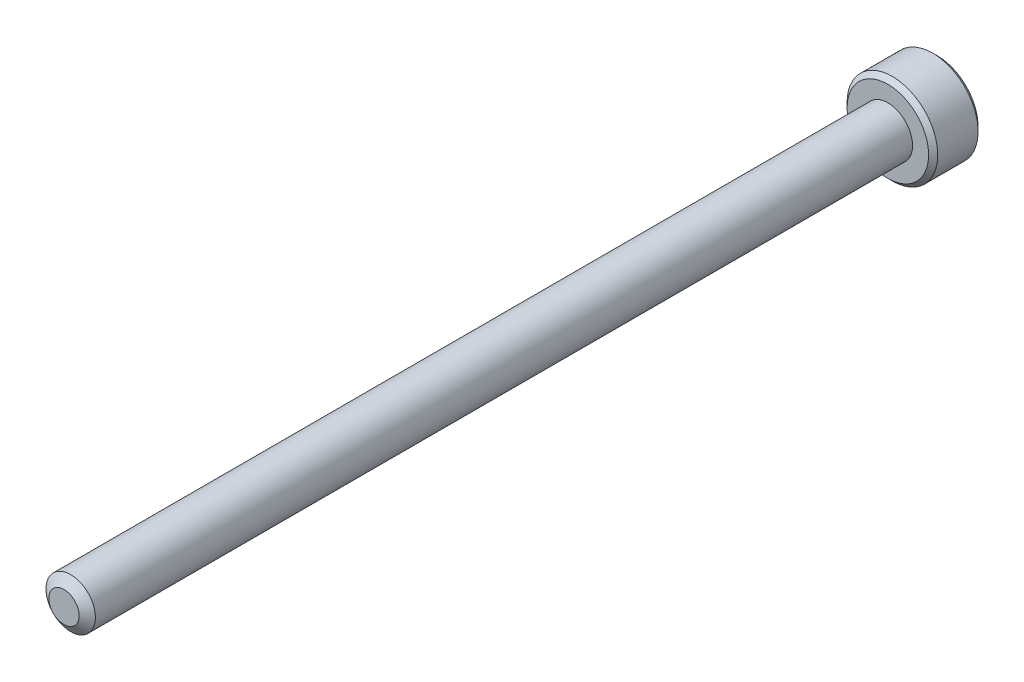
ISO-10303-21;
HEADER;
FILE_DESCRIPTION(('STEP AP214'),'2;1');
FILE_NAME('part.step','',(''),(''),'','','');
FILE_SCHEMA(('AUTOMOTIVE_DESIGN { 1 0 10303 214 1 1 1 1 }'));
ENDSEC;
DATA;
#1=APPLICATION_CONTEXT('core data for automotive mechanical design processes');
#2=APPLICATION_PROTOCOL_DEFINITION('international standard','automotive_design',2000,#1);
#3=PRODUCT_CONTEXT('',#1,'mechanical');
#4=PRODUCT('Part','Part','',(#3));
#5=PRODUCT_RELATED_PRODUCT_CATEGORY('part','',(#4));
#6=PRODUCT_DEFINITION_FORMATION('','',#4);
#7=PRODUCT_DEFINITION_CONTEXT('part definition',#1,'design');
#8=PRODUCT_DEFINITION('design','',#6,#7);
#9=PRODUCT_DEFINITION_SHAPE('','',#8);
#10=(LENGTH_UNIT() NAMED_UNIT(*) SI_UNIT(.MILLI.,.METRE.));
#11=(NAMED_UNIT(*) PLANE_ANGLE_UNIT() SI_UNIT($,.RADIAN.));
#12=(NAMED_UNIT(*) SI_UNIT($,.STERADIAN.) SOLID_ANGLE_UNIT());
#13=UNCERTAINTY_MEASURE_WITH_UNIT(LENGTH_MEASURE(1.E-05),#10,'distance_accuracy_value','');
#14=(GEOMETRIC_REPRESENTATION_CONTEXT(3) GLOBAL_UNCERTAINTY_ASSIGNED_CONTEXT((#13)) GLOBAL_UNIT_ASSIGNED_CONTEXT((#10,
#11,#12)) REPRESENTATION_CONTEXT('',''));
#15=CARTESIAN_POINT('',(0.,0.,0.));
#16=DIRECTION('',(0.,0.,1.));
#17=DIRECTION('',(1.,0.,0.));
#18=AXIS2_PLACEMENT_3D('',#15,#16,#17);
#19=CARTESIAN_POINT('',(0.,0.,-50.));
#20=DIRECTION('',(0.,0.,1.));
#21=DIRECTION('',(1.,0.,0.));
#22=AXIS2_PLACEMENT_3D('',#19,#20,#21);
#23=CYLINDRICAL_SURFACE('',#22,1.5);
#24=CARTESIAN_POINT('',(0.,0.,-50.));
#25=DIRECTION('',(0.,0.,-1.));
#26=DIRECTION('',(-1.,0.,0.));
#27=AXIS2_PLACEMENT_3D('',#24,#25,#26);
#28=CIRCLE('',#27,1.5);
#29=CARTESIAN_POINT('',(-1.5,0.,-50.));
#30=VERTEX_POINT('',#29);
#31=EDGE_CURVE('E212',#30,#30,#28,.F.);
#32=ORIENTED_EDGE('',*,*,#31,.T.);
#33=EDGE_LOOP('',(#32));
#34=FACE_BOUND('',#33,.T.);
#35=CARTESIAN_POINT('',(0.,0.,-0.40525178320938));
#36=DIRECTION('',(0.,0.,1.));
#37=DIRECTION('',(1.,0.,0.));
#38=AXIS2_PLACEMENT_3D('',#35,#36,#37);
#39=CIRCLE('',#38,1.5);
#40=CARTESIAN_POINT('',(1.5,0.,-0.40525178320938));
#41=VERTEX_POINT('',#40);
#42=EDGE_CURVE('E106',#41,#41,#39,.T.);
#43=ORIENTED_EDGE('',*,*,#42,.F.);
#44=EDGE_LOOP('',(#43));
#45=FACE_BOUND('',#44,.T.);
#46=ADVANCED_FACE('F32',(#34,#45),#23,.T.);
#47=CARTESIAN_POINT('',(0.,0.,0.));
#48=DIRECTION('',(0.,0.,-1.));
#49=DIRECTION('',(-1.,0.,0.));
#50=AXIS2_PLACEMENT_3D('',#47,#48,#49);
#51=CONICAL_SURFACE('',#50,0.921240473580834,0.959931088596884);
#52=ORIENTED_EDGE('',*,*,#42,.T.);
#53=EDGE_LOOP('',(#52));
#54=FACE_BOUND('',#53,.T.);
#55=CARTESIAN_POINT('',(0.,0.,0.));
#56=DIRECTION('',(0.,0.,1.));
#57=DIRECTION('',(1.,0.,0.));
#58=AXIS2_PLACEMENT_3D('',#55,#56,#57);
#59=CIRCLE('',#58,0.921240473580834);
#60=CARTESIAN_POINT('',(0.921240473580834,0.,0.));
#61=VERTEX_POINT('',#60);
#62=EDGE_CURVE('E210',#61,#61,#59,.T.);
#63=ORIENTED_EDGE('',*,*,#62,.F.);
#64=EDGE_LOOP('',(#63));
#65=FACE_BOUND('',#64,.T.);
#66=ADVANCED_FACE('F193',(#54,#65),#51,.T.);
#67=CARTESIAN_POINT('',(0.,0.,0.));
#68=DIRECTION('',(0.,0.,1.));
#69=DIRECTION('',(1.,0.,0.));
#70=AXIS2_PLACEMENT_3D('',#67,#68,#69);
#71=PLANE('',#70);
#72=ORIENTED_EDGE('',*,*,#62,.T.);
#73=EDGE_LOOP('',(#72));
#74=FACE_BOUND('',#73,.T.);
#75=ADVANCED_FACE('F190',(#74),#71,.T.);
#76=CARTESIAN_POINT('',(0.,0.,-53.));
#77=DIRECTION('',(0.,0.,1.));
#78=DIRECTION('',(1.,0.,0.));
#79=AXIS2_PLACEMENT_3D('',#76,#77,#78);
#80=CYLINDRICAL_SURFACE('',#79,2.75);
#81=CARTESIAN_POINT('',(0.,0.,-52.725));
#82=DIRECTION('',(0.,0.,-1.));
#83=DIRECTION('',(-1.,0.,0.));
#84=AXIS2_PLACEMENT_3D('',#81,#82,#83);
#85=CIRCLE('',#84,2.75);
#86=CARTESIAN_POINT('',(-2.75,0.,-52.725));
#87=VERTEX_POINT('',#86);
#88=EDGE_CURVE('E40',#87,#87,#85,.F.);
#89=ORIENTED_EDGE('',*,*,#88,.T.);
#90=EDGE_LOOP('',(#89));
#91=FACE_BOUND('',#90,.T.);
#92=CARTESIAN_POINT('',(0.,0.,-50.275));
#93=DIRECTION('',(0.,0.,-1.));
#94=DIRECTION('',(-1.,0.,0.));
#95=AXIS2_PLACEMENT_3D('',#92,#93,#94);
#96=CIRCLE('',#95,2.75);
#97=CARTESIAN_POINT('',(-2.75,0.,-50.275));
#98=VERTEX_POINT('',#97);
#99=EDGE_CURVE('E169',#98,#98,#96,.T.);
#100=ORIENTED_EDGE('',*,*,#99,.T.);
#101=EDGE_LOOP('',(#100));
#102=FACE_BOUND('',#101,.T.);
#103=ADVANCED_FACE('F174',(#91,#102),#80,.T.);
#104=CARTESIAN_POINT('',(0.,0.,-53.));
#105=DIRECTION('',(0.,0.,-1.));
#106=DIRECTION('',(-1.,0.,0.));
#107=AXIS2_PLACEMENT_3D('',#104,#105,#106);
#108=PLANE('',#107);
#109=CARTESIAN_POINT('',(0.,0.,-53.));
#110=DIRECTION('',(0.,0.,-1.));
#111=DIRECTION('',(-1.,0.,0.));
#112=AXIS2_PLACEMENT_3D('',#109,#110,#111);
#113=CIRCLE('',#112,2.47500000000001);
#114=CARTESIAN_POINT('',(-2.47500000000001,0.,-53.));
#115=VERTEX_POINT('',#114);
#116=EDGE_CURVE('E105',#115,#115,#113,.T.);
#117=ORIENTED_EDGE('',*,*,#116,.T.);
#118=EDGE_LOOP('',(#117));
#119=FACE_BOUND('',#118,.T.);
#120=CARTESIAN_POINT('',(0.,0.,-53.));
#121=DIRECTION('',(0.,0.,-1.));
#122=DIRECTION('',(-1.,0.,0.));
#123=AXIS2_PLACEMENT_3D('',#120,#121,#122);
#124=CIRCLE('',#123,1.44337567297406);
#125=CARTESIAN_POINT('',(-1.25,0.721687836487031,-53.));
#126=VERTEX_POINT('',#125);
#127=CARTESIAN_POINT('',(0.,1.44337567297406,-53.));
#128=VERTEX_POINT('',#127);
#129=EDGE_CURVE('E86',#126,#128,#124,.T.);
#130=ORIENTED_EDGE('',*,*,#129,.F.);
#131=CARTESIAN_POINT('',(-1.25,-0.721687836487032,-53.));
#132=VERTEX_POINT('',#131);
#133=EDGE_CURVE('E46',#132,#126,#124,.T.);
#134=ORIENTED_EDGE('',*,*,#133,.F.);
#135=CARTESIAN_POINT('',(0.,-1.44337567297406,-53.));
#136=VERTEX_POINT('',#135);
#137=EDGE_CURVE('E271',#136,#132,#124,.T.);
#138=ORIENTED_EDGE('',*,*,#137,.F.);
#139=CARTESIAN_POINT('',(1.25,-0.721687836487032,-53.));
#140=VERTEX_POINT('',#139);
#141=EDGE_CURVE('E53',#140,#136,#124,.T.);
#142=ORIENTED_EDGE('',*,*,#141,.F.);
#143=CARTESIAN_POINT('',(1.25,0.721687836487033,-53.));
#144=VERTEX_POINT('',#143);
#145=EDGE_CURVE('E127',#144,#140,#124,.T.);
#146=ORIENTED_EDGE('',*,*,#145,.F.);
#147=EDGE_CURVE('E95',#128,#144,#124,.T.);
#148=ORIENTED_EDGE('',*,*,#147,.F.);
#149=EDGE_LOOP('',(#130,#134,#138,#142,#146,#148));
#150=FACE_BOUND('',#149,.T.);
#151=ADVANCED_FACE('F126',(#119,#150),#108,.T.);
#152=CARTESIAN_POINT('',(0.,0.,-50.));
#153=DIRECTION('',(0.,0.,-1.));
#154=DIRECTION('',(-1.,0.,0.));
#155=AXIS2_PLACEMENT_3D('',#152,#153,#154);
#156=PLANE('',#155);
#157=CARTESIAN_POINT('',(0.,0.,-50.));
#158=DIRECTION('',(0.,0.,-1.));
#159=DIRECTION('',(-1.,0.,0.));
#160=AXIS2_PLACEMENT_3D('',#157,#158,#159);
#161=CIRCLE('',#160,2.475);
#162=CARTESIAN_POINT('',(-2.475,0.,-50.));
#163=VERTEX_POINT('',#162);
#164=EDGE_CURVE('E11',#163,#163,#161,.F.);
#165=ORIENTED_EDGE('',*,*,#164,.T.);
#166=EDGE_LOOP('',(#165));
#167=FACE_BOUND('',#166,.T.);
#168=ORIENTED_EDGE('',*,*,#31,.F.);
#169=EDGE_LOOP('',(#168));
#170=FACE_BOUND('',#169,.T.);
#171=ADVANCED_FACE('F183',(#167,#170),#156,.F.);
#172=CARTESIAN_POINT('',(0.,0.,-53.));
#173=DIRECTION('',(0.,0.,-1.));
#174=DIRECTION('',(-1.,0.,0.));
#175=AXIS2_PLACEMENT_3D('',#172,#173,#174);
#176=CONICAL_SURFACE('',#175,1.44337567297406,0.78539816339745);
#177=ORIENTED_EDGE('',*,*,#147,.T.);
#178=CARTESIAN_POINT('',(-0.000200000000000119,1.4434911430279,-53.0001154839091));
#179=CARTESIAN_POINT('',(0.0427751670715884,1.41867941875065,-52.9753216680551));
#180=CARTESIAN_POINT('',(0.0864690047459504,1.39345276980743,-52.9519837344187));
#181=CARTESIAN_POINT('',(0.175565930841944,1.34201263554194,-52.9092520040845));
#182=CARTESIAN_POINT('',(0.220977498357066,1.31579425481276,-52.8898819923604));
#183=CARTESIAN_POINT('',(0.312547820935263,1.26292610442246,-52.8567004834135));
#184=CARTESIAN_POINT('',(0.35868324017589,1.23628980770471,-52.8428055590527));
#185=CARTESIAN_POINT('',(0.451970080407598,1.18243062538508,-52.8213972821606));
#186=CARTESIAN_POINT('',(0.499118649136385,1.15520938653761,-52.8138679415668));
#187=CARTESIAN_POINT('',(0.580373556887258,1.10829684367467,-52.8070744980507));
#188=CARTESIAN_POINT('',(0.614374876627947,1.08866617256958,-52.8060685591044));
#189=CARTESIAN_POINT('',(0.682317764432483,1.04943932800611,-52.8077614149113));
#190=CARTESIAN_POINT('',(0.716259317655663,1.02984316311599,-52.8104610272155));
#191=CARTESIAN_POINT('',(0.783814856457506,0.990839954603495,-52.8194089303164));
#192=CARTESIAN_POINT('',(0.817428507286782,0.971433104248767,-52.8256605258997));
#193=CARTESIAN_POINT('',(0.88409463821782,0.932943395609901,-52.8413756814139));
#194=CARTESIAN_POINT('',(0.917146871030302,0.913860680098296,-52.8508406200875));
#195=CARTESIAN_POINT('',(1.00179969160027,0.864986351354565,-52.8789313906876));
#196=CARTESIAN_POINT('',(1.05286649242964,0.835502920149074,-52.8996701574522));
#197=CARTESIAN_POINT('',(1.15300085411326,0.777690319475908,-52.9463871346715));
#198=CARTESIAN_POINT('',(1.20207431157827,0.749357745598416,-52.9723482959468));
#199=CARTESIAN_POINT('',(1.2502,0.721572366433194,-53.0001154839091));
#200=B_SPLINE_CURVE_WITH_KNOTS('',3,(#178,#179,#180,#181,#182,#183,#184,#185,#186,#187,#188,
#189,#190,#191,#192,#193,#194,#195,#196,#197,#198,#199),.UNSPECIFIED.,.F.,.F.,(4,2,2,2,2,2,2,2,
2,2,4),(0.,0.166533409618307,0.334037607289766,0.498880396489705,0.663307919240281,
0.780963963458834,0.898645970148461,1.01643764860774,1.1342799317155,1.32148652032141,
1.50809158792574),.UNSPECIFIED.);
#201=EDGE_CURVE('E100',#128,#144,#200,.T.);
#202=ORIENTED_EDGE('',*,*,#201,.F.);
#203=EDGE_LOOP('',(#177,#202));
#204=FACE_BOUND('',#203,.T.);
#205=ADVANCED_FACE('F101',(#204),#176,.F.);
#206=ORIENTED_EDGE('',*,*,#145,.T.);
#207=CARTESIAN_POINT('',(1.25,-1.43934010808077,-53.4629820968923));
#208=CARTESIAN_POINT('',(1.25,-1.40429313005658,-53.4365249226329));
#209=CARTESIAN_POINT('',(1.25,-1.36905087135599,-53.4103271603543));
#210=CARTESIAN_POINT('',(1.25,-1.29809650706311,-53.3585575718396));
#211=CARTESIAN_POINT('',(1.25,-1.26238428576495,-53.3329859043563));
#212=CARTESIAN_POINT('',(1.25,-1.15390111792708,-53.2570059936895));
#213=CARTESIAN_POINT('',(1.25,-1.08031646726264,-53.2077402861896));
#214=CARTESIAN_POINT('',(1.25,-0.926012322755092,-53.1110258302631));
#215=CARTESIAN_POINT('',(1.25,-0.845125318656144,-53.0638412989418));
#216=CARTESIAN_POINT('',(1.25,-0.6793111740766,-52.9775307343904));
#217=CARTESIAN_POINT('',(1.25,-0.594398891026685,-52.9383775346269));
#218=CARTESIAN_POINT('',(1.25,-0.466944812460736,-52.8904772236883));
#219=CARTESIAN_POINT('',(1.25,-0.426289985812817,-52.8767294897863));
#220=CARTESIAN_POINT('',(1.25,-0.343998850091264,-52.8524979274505));
#221=CARTESIAN_POINT('',(1.25,-0.30236247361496,-52.8420143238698));
#222=CARTESIAN_POINT('',(1.25,-0.219052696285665,-52.8250301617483));
#223=CARTESIAN_POINT('',(1.25,-0.1773934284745,-52.8184613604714));
#224=CARTESIAN_POINT('',(1.25,-0.0936293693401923,-52.8094350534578));
#225=CARTESIAN_POINT('',(1.25,-0.0515246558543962,-52.8069768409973));
#226=CARTESIAN_POINT('',(1.25,0.0311890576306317,-52.8063540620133));
#227=CARTESIAN_POINT('',(1.25,0.0717969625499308,-52.8080371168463));
#228=CARTESIAN_POINT('',(1.25,0.152668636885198,-52.8152682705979));
#229=CARTESIAN_POINT('',(1.25,0.192932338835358,-52.8208171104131));
#230=CARTESIAN_POINT('',(1.25,0.273499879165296,-52.835571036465));
#231=CARTESIAN_POINT('',(1.25,0.313792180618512,-52.8448381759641));
#232=CARTESIAN_POINT('',(1.25,0.393496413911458,-52.8665361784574));
#233=CARTESIAN_POINT('',(1.25,0.432908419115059,-52.8789667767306));
#234=CARTESIAN_POINT('',(1.25,0.556992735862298,-52.9227793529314));
#235=CARTESIAN_POINT('',(1.25,0.639898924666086,-52.959151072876));
#236=CARTESIAN_POINT('',(1.25,0.801816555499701,-53.0400191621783));
#237=CARTESIAN_POINT('',(1.25,0.880812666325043,-53.084544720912));
#238=CARTESIAN_POINT('',(1.25,1.03178561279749,-53.1764048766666));
#239=CARTESIAN_POINT('',(1.25,1.10391618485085,-53.2234899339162));
#240=CARTESIAN_POINT('',(1.25,1.2101860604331,-53.2962785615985));
#241=CARTESIAN_POINT('',(1.25,1.24515069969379,-53.3207980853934));
#242=CARTESIAN_POINT('',(1.25,1.31460220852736,-53.3704856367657));
#243=CARTESIAN_POINT('',(1.25,1.34908920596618,-53.3956534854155));
#244=CARTESIAN_POINT('',(1.25,1.38337731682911,-53.4210901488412));
#245=B_SPLINE_CURVE_WITH_KNOTS('',3,(#207,#208,#209,#210,#211,#212,#213,#214,#215,#216,#217,
#218,#219,#220,#221,#222,#223,#224,#225,#226,#227,#228,#229,#230,#231,#232,#233,#234,#235,#236,
#237,#238,#239,#240,#241,#242,#243,#244),.UNSPECIFIED.,.F.,.F.,(4,2,2,2,2,2,2,2,2,2,2,2,2,2,2,2,
2,2,4),(0.,0.131732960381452,0.263498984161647,0.529042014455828,0.80974192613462,
1.08947609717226,1.21811634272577,1.34676544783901,1.47310084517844,1.59941451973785,
1.72115042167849,1.84290966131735,1.96679153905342,2.09066305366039,2.36146692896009,
2.63325989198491,2.89154668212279,3.01965734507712,3.14773302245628),.UNSPECIFIED.);
#246=EDGE_CURVE('E94',#144,#140,#245,.F.);
#247=ORIENTED_EDGE('',*,*,#246,.F.);
#248=EDGE_LOOP('',(#206,#247));
#249=FACE_BOUND('',#248,.T.);
#250=ADVANCED_FACE('F277',(#249),#176,.F.);
#251=ORIENTED_EDGE('',*,*,#141,.T.);
#252=CARTESIAN_POINT('',(1.2502,-0.721572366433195,-53.0001154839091));
#253=CARTESIAN_POINT('',(1.20722483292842,-0.746384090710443,-52.9753216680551));
#254=CARTESIAN_POINT('',(1.16353099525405,-0.771610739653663,-52.9519837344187));
#255=CARTESIAN_POINT('',(1.07443406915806,-0.823050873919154,-52.9092520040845));
#256=CARTESIAN_POINT('',(1.02902250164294,-0.849269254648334,-52.8898819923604));
#257=CARTESIAN_POINT('',(0.937452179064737,-0.902137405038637,-52.8567004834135));
#258=CARTESIAN_POINT('',(0.891316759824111,-0.928773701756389,-52.8428055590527));
#259=CARTESIAN_POINT('',(0.798029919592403,-0.982632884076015,-52.8213972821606));
#260=CARTESIAN_POINT('',(0.750881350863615,-1.00985412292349,-52.8138679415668));
#261=CARTESIAN_POINT('',(0.669626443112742,-1.05676666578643,-52.8070744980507));
#262=CARTESIAN_POINT('',(0.635625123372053,-1.07639733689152,-52.8060685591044));
#263=CARTESIAN_POINT('',(0.567682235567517,-1.11562418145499,-52.8077614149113));
#264=CARTESIAN_POINT('',(0.533740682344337,-1.13522034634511,-52.8104610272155));
#265=CARTESIAN_POINT('',(0.466185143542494,-1.1742235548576,-52.8194089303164));
#266=CARTESIAN_POINT('',(0.432571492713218,-1.19363040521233,-52.8256605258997));
#267=CARTESIAN_POINT('',(0.365905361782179,-1.2321201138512,-52.8413756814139));
#268=CARTESIAN_POINT('',(0.332853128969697,-1.2512028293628,-52.8508406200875));
#269=CARTESIAN_POINT('',(0.248200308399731,-1.30007715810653,-52.8789313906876));
#270=CARTESIAN_POINT('',(0.197133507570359,-1.32956058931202,-52.8996701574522));
#271=CARTESIAN_POINT('',(0.0969991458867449,-1.38737318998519,-52.9463871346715));
#272=CARTESIAN_POINT('',(0.0479256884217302,-1.41570576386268,-52.9723482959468));
#273=CARTESIAN_POINT('',(-0.000200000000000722,-1.4434911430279,-53.0001154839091));
#274=B_SPLINE_CURVE_WITH_KNOTS('',3,(#252,#253,#254,#255,#256,#257,#258,#259,#260,#261,#262,
#263,#264,#265,#266,#267,#268,#269,#270,#271,#272,#273),.UNSPECIFIED.,.F.,.F.,(4,2,2,2,2,2,2,2,
2,2,4),(0.,0.166533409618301,0.334037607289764,0.498880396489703,0.663307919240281,
0.780963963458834,0.898645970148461,1.01643764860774,1.1342799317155,1.32148652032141,
1.50809158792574),.UNSPECIFIED.);
#275=EDGE_CURVE('E137',#140,#136,#274,.T.);
#276=ORIENTED_EDGE('',*,*,#275,.F.);
#277=EDGE_LOOP('',(#251,#276));
#278=FACE_BOUND('',#277,.T.);
#279=ADVANCED_FACE('F274',(#278),#176,.F.);
#280=ORIENTED_EDGE('',*,*,#137,.T.);
#281=CARTESIAN_POINT('',(0.000200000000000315,-1.4434911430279,-53.0001154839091));
#282=CARTESIAN_POINT('',(-0.0427751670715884,-1.41867941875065,-52.9753216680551));
#283=CARTESIAN_POINT('',(-0.0864690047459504,-1.39345276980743,-52.9519837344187));
#284=CARTESIAN_POINT('',(-0.175565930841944,-1.34201263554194,-52.9092520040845));
#285=CARTESIAN_POINT('',(-0.220977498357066,-1.31579425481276,-52.8898819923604));
#286=CARTESIAN_POINT('',(-0.312547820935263,-1.26292610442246,-52.8567004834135));
#287=CARTESIAN_POINT('',(-0.35868324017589,-1.23628980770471,-52.8428055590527));
#288=CARTESIAN_POINT('',(-0.451970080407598,-1.18243062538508,-52.8213972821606));
#289=CARTESIAN_POINT('',(-0.499118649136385,-1.15520938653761,-52.8138679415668));
#290=CARTESIAN_POINT('',(-0.580373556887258,-1.10829684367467,-52.8070744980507));
#291=CARTESIAN_POINT('',(-0.614374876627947,-1.08866617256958,-52.8060685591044));
#292=CARTESIAN_POINT('',(-0.682317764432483,-1.04943932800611,-52.8077614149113));
#293=CARTESIAN_POINT('',(-0.716259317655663,-1.02984316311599,-52.8104610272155));
#294=CARTESIAN_POINT('',(-0.783814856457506,-0.990839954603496,-52.8194089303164));
#295=CARTESIAN_POINT('',(-0.817428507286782,-0.971433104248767,-52.8256605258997));
#296=CARTESIAN_POINT('',(-0.88409463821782,-0.932943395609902,-52.8413756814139));
#297=CARTESIAN_POINT('',(-0.917146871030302,-0.913860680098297,-52.8508406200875));
#298=CARTESIAN_POINT('',(-1.00179969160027,-0.864986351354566,-52.8789313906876));
#299=CARTESIAN_POINT('',(-1.05286649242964,-0.835502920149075,-52.8996701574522));
#300=CARTESIAN_POINT('',(-1.15300085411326,-0.777690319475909,-52.9463871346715));
#301=CARTESIAN_POINT('',(-1.20207431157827,-0.749357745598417,-52.9723482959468));
#302=CARTESIAN_POINT('',(-1.2502,-0.721572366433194,-53.0001154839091));
#303=B_SPLINE_CURVE_WITH_KNOTS('',3,(#281,#282,#283,#284,#285,#286,#287,#288,#289,#290,#291,
#292,#293,#294,#295,#296,#297,#298,#299,#300,#301,#302),.UNSPECIFIED.,.F.,.F.,(4,2,2,2,2,2,2,2,
2,2,4),(0.,0.166533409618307,0.334037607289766,0.498880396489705,0.663307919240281,
0.780963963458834,0.898645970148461,1.01643764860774,1.1342799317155,1.32148652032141,
1.50809158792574),.UNSPECIFIED.);
#304=EDGE_CURVE('E248',#136,#132,#303,.T.);
#305=ORIENTED_EDGE('',*,*,#304,.F.);
#306=EDGE_LOOP('',(#280,#305));
#307=FACE_BOUND('',#306,.T.);
#308=ADVANCED_FACE('F273',(#307),#176,.F.);
#309=ORIENTED_EDGE('',*,*,#133,.T.);
#310=CARTESIAN_POINT('',(-1.25,-1.43934010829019,-53.4629820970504));
#311=CARTESIAN_POINT('',(-1.25,-1.40429313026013,-53.4365249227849));
#312=CARTESIAN_POINT('',(-1.25,-1.36905087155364,-53.4103271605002));
#313=CARTESIAN_POINT('',(-1.25,-1.29809650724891,-53.3585575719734));
#314=CARTESIAN_POINT('',(-1.25,-1.2623842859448,-53.3329859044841));
#315=CARTESIAN_POINT('',(-1.25,-1.15390111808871,-53.257005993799));
#316=CARTESIAN_POINT('',(-1.25,-1.08031646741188,-53.207740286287));
#317=CARTESIAN_POINT('',(-1.25,-0.926012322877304,-53.1110258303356));
#318=CARTESIAN_POINT('',(-1.25,-0.84512531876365,-53.0638412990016));
#319=CARTESIAN_POINT('',(-1.25,-0.679311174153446,-52.9775307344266));
#320=CARTESIAN_POINT('',(-1.25,-0.594398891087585,-52.9383775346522));
#321=CARTESIAN_POINT('',(-1.25,-0.466944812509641,-52.8904772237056));
#322=CARTESIAN_POINT('',(-1.25,-0.426289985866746,-52.8767294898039));
#323=CARTESIAN_POINT('',(-1.25,-0.343998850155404,-52.8524979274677));
#324=CARTESIAN_POINT('',(-1.25,-0.302362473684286,-52.8420143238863));
#325=CARTESIAN_POINT('',(-1.25,-0.219052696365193,-52.8250301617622));
#326=CARTESIAN_POINT('',(-1.25,-0.177393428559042,-52.8184613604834));
#327=CARTESIAN_POINT('',(-1.25,-0.0936293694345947,-52.809435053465));
#328=CARTESIAN_POINT('',(-1.25,-0.051524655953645,-52.8069768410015));
#329=CARTESIAN_POINT('',(-1.25,0.0311890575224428,-52.8063540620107));
#330=CARTESIAN_POINT('',(-1.25,0.0717969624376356,-52.8080371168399));
#331=CARTESIAN_POINT('',(-1.25,0.152668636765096,-52.8152682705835));
#332=CARTESIAN_POINT('',(-1.25,0.192932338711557,-52.8208171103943));
#333=CARTESIAN_POINT('',(-1.25,0.273499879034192,-52.835571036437));
#334=CARTESIAN_POINT('',(-1.25,0.313792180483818,-52.8448381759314));
#335=CARTESIAN_POINT('',(-1.25,0.393496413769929,-52.8665361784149));
#336=CARTESIAN_POINT('',(-1.25,0.432908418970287,-52.8789667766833));
#337=CARTESIAN_POINT('',(-1.25,0.556992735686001,-52.9227793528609));
#338=CARTESIAN_POINT('',(-1.25,0.639898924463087,-52.9591510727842));
#339=CARTESIAN_POINT('',(-1.25,0.801816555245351,-53.0400191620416));
#340=CARTESIAN_POINT('',(-1.25,0.880812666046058,-53.0845447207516));
#341=CARTESIAN_POINT('',(-1.25,1.03178561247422,-53.176404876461));
#342=CARTESIAN_POINT('',(-1.25,1.10391618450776,-53.2234899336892));
#343=CARTESIAN_POINT('',(-1.25,1.21018606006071,-53.2962785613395));
#344=CARTESIAN_POINT('',(-1.25,1.24515069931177,-53.3207980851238));
#345=CARTESIAN_POINT('',(-1.25,1.31460220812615,-53.3704856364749));
#346=CARTESIAN_POINT('',(-1.25,1.3490892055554,-53.3956534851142));
#347=CARTESIAN_POINT('',(-1.25,1.38337731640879,-53.4210901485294));
#348=B_SPLINE_CURVE_WITH_KNOTS('',3,(#310,#311,#312,#313,#314,#315,#316,#317,#318,#319,#320,
#321,#322,#323,#324,#325,#326,#327,#328,#329,#330,#331,#332,#333,#334,#335,#336,#337,#338,#339,
#340,#341,#342,#343,#344,#345,#346,#347),.UNSPECIFIED.,.F.,.F.,(4,2,2,2,2,2,2,2,2,2,2,2,2,2,2,2,
2,2,4),(0.,0.131732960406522,0.263498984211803,0.529042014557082,0.80974192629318,
1.08947609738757,1.21811634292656,1.3467654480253,1.47310084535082,1.59941451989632,
1.72115042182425,1.84290966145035,1.9667915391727,2.09066305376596,2.36146692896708,
2.63325989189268,2.89154668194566,3.01965734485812,3.14773302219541),.UNSPECIFIED.);
#349=EDGE_CURVE('E116',#132,#126,#348,.T.);
#350=ORIENTED_EDGE('',*,*,#349,.F.);
#351=EDGE_LOOP('',(#309,#350));
#352=FACE_BOUND('',#351,.T.);
#353=ADVANCED_FACE('F286',(#352),#176,.F.);
#354=ORIENTED_EDGE('',*,*,#129,.T.);
#355=CARTESIAN_POINT('',(-1.2502,0.721572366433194,-53.0001154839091));
#356=CARTESIAN_POINT('',(-1.20722483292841,0.746384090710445,-52.9753216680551));
#357=CARTESIAN_POINT('',(-1.16353099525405,0.771610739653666,-52.9519837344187));
#358=CARTESIAN_POINT('',(-1.07443406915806,0.823050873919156,-52.9092520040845));
#359=CARTESIAN_POINT('',(-1.02902250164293,0.849269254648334,-52.8898819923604));
#360=CARTESIAN_POINT('',(-0.937452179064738,0.902137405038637,-52.8567004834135));
#361=CARTESIAN_POINT('',(-0.891316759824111,0.928773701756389,-52.8428055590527));
#362=CARTESIAN_POINT('',(-0.798029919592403,0.982632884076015,-52.8213972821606));
#363=CARTESIAN_POINT('',(-0.750881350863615,1.00985412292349,-52.8138679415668));
#364=CARTESIAN_POINT('',(-0.669626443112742,1.05676666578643,-52.8070744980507));
#365=CARTESIAN_POINT('',(-0.635625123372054,1.07639733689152,-52.8060685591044));
#366=CARTESIAN_POINT('',(-0.567682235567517,1.11562418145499,-52.8077614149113));
#367=CARTESIAN_POINT('',(-0.533740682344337,1.13522034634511,-52.8104610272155));
#368=CARTESIAN_POINT('',(-0.466185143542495,1.1742235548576,-52.8194089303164));
#369=CARTESIAN_POINT('',(-0.43257149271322,1.19363040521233,-52.8256605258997));
#370=CARTESIAN_POINT('',(-0.365905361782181,1.23212011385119,-52.8413756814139));
#371=CARTESIAN_POINT('',(-0.332853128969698,1.2512028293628,-52.8508406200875));
#372=CARTESIAN_POINT('',(-0.24820030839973,1.30007715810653,-52.8789313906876));
#373=CARTESIAN_POINT('',(-0.197133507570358,1.32956058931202,-52.8996701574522));
#374=CARTESIAN_POINT('',(-0.096999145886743,1.38737318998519,-52.9463871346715));
#375=CARTESIAN_POINT('',(-0.047925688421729,1.41570576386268,-52.9723482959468));
#376=CARTESIAN_POINT('',(0.000200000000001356,1.4434911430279,-53.0001154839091));
#377=B_SPLINE_CURVE_WITH_KNOTS('',3,(#355,#356,#357,#358,#359,#360,#361,#362,#363,#364,#365,
#366,#367,#368,#369,#370,#371,#372,#373,#374,#375,#376),.UNSPECIFIED.,.F.,.F.,(4,2,2,2,2,2,2,2,
2,2,4),(0.,0.166533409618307,0.334037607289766,0.498880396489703,0.663307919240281,
0.780963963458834,0.898645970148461,1.01643764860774,1.1342799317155,1.32148652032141,
1.50809158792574),.UNSPECIFIED.);
#378=EDGE_CURVE('E90',#126,#128,#377,.T.);
#379=ORIENTED_EDGE('',*,*,#378,.F.);
#380=EDGE_LOOP('',(#354,#379));
#381=FACE_BOUND('',#380,.T.);
#382=ADVANCED_FACE('F88',(#381),#176,.F.);
#383=CARTESIAN_POINT('',(1.25,2.1650635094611,-51.125));
#384=DIRECTION('',(0.,0.,-1.));
#385=DIRECTION('',(-1.,0.,0.));
#386=AXIS2_PLACEMENT_3D('',#383,#384,#385);
#387=PLANE('',#386);
#388=DIRECTION('',(0.866025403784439,0.5,0.));
#389=VECTOR('',#388,1.);
#390=CARTESIAN_POINT('',(-1.25,0.721687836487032,-51.125));
#391=LINE('',#390,#389);
#392=CARTESIAN_POINT('',(-1.25,0.721687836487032,-51.125));
#393=VERTEX_POINT('',#392);
#394=CARTESIAN_POINT('',(0.,1.44337567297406,-51.125));
#395=VERTEX_POINT('',#394);
#396=EDGE_CURVE('E115',#393,#395,#391,.T.);
#397=ORIENTED_EDGE('',*,*,#396,.T.);
#398=DIRECTION('',(0.866025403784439,-0.5,0.));
#399=VECTOR('',#398,1.);
#400=CARTESIAN_POINT('',(0.,1.44337567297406,-51.125));
#401=LINE('',#400,#399);
#402=CARTESIAN_POINT('',(1.25,0.721687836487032,-51.125));
#403=VERTEX_POINT('',#402);
#404=EDGE_CURVE('E120',#395,#403,#401,.T.);
#405=ORIENTED_EDGE('',*,*,#404,.T.);
#406=DIRECTION('',(0.,-1.,0.));
#407=VECTOR('',#406,1.);
#408=CARTESIAN_POINT('',(1.25,0.721687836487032,-51.125));
#409=LINE('',#408,#407);
#410=CARTESIAN_POINT('',(1.25,-0.721687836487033,-51.125));
#411=VERTEX_POINT('',#410);
#412=EDGE_CURVE('E234',#403,#411,#409,.T.);
#413=ORIENTED_EDGE('',*,*,#412,.T.);
#414=DIRECTION('',(-0.866025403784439,-0.5,0.));
#415=VECTOR('',#414,1.);
#416=CARTESIAN_POINT('',(1.25,-0.721687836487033,-51.125));
#417=LINE('',#416,#415);
#418=CARTESIAN_POINT('',(0.,-1.44337567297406,-51.125));
#419=VERTEX_POINT('',#418);
#420=EDGE_CURVE('E231',#411,#419,#417,.T.);
#421=ORIENTED_EDGE('',*,*,#420,.T.);
#422=DIRECTION('',(-0.866025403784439,0.5,0.));
#423=VECTOR('',#422,1.);
#424=CARTESIAN_POINT('',(0.,-1.44337567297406,-51.125));
#425=LINE('',#424,#423);
#426=CARTESIAN_POINT('',(-1.25,-0.721687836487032,-51.125));
#427=VERTEX_POINT('',#426);
#428=EDGE_CURVE('E228',#419,#427,#425,.T.);
#429=ORIENTED_EDGE('',*,*,#428,.T.);
#430=DIRECTION('',(0.,1.,0.));
#431=VECTOR('',#430,1.);
#432=CARTESIAN_POINT('',(-1.25,-0.721687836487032,-51.125));
#433=LINE('',#432,#431);
#434=EDGE_CURVE('E123',#427,#393,#433,.T.);
#435=ORIENTED_EDGE('',*,*,#434,.T.);
#436=EDGE_LOOP('',(#397,#405,#413,#421,#429,#435));
#437=FACE_BOUND('',#436,.T.);
#438=ADVANCED_FACE('F157',(#437),#387,.T.);
#439=CARTESIAN_POINT('',(0.,1.44337567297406,-51.125));
#440=DIRECTION('',(0.5,0.866025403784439,0.));
#441=DIRECTION('',(-0.866025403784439,0.5,0.));
#442=AXIS2_PLACEMENT_3D('',#439,#440,#441);
#443=PLANE('',#442);
#444=DIRECTION('',(0.,0.,-1.));
#445=VECTOR('',#444,1.);
#446=CARTESIAN_POINT('',(0.,1.44337567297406,-51.125));
#447=LINE('',#446,#445);
#448=EDGE_CURVE('E112',#395,#128,#447,.T.);
#449=ORIENTED_EDGE('',*,*,#448,.T.);
#450=ORIENTED_EDGE('',*,*,#201,.T.);
#451=DIRECTION('',(0.,0.,-1.));
#452=VECTOR('',#451,1.);
#453=CARTESIAN_POINT('',(1.25,0.721687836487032,-51.125));
#454=LINE('',#453,#452);
#455=EDGE_CURVE('E122',#403,#144,#454,.T.);
#456=ORIENTED_EDGE('',*,*,#455,.F.);
#457=ORIENTED_EDGE('',*,*,#404,.F.);
#458=EDGE_LOOP('',(#449,#450,#456,#457));
#459=FACE_BOUND('',#458,.T.);
#460=ADVANCED_FACE('F118',(#459),#443,.F.);
#461=CARTESIAN_POINT('',(1.25,0.721687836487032,-51.125));
#462=DIRECTION('',(1.,0.,0.));
#463=DIRECTION('',(0.,0.,-1.));
#464=AXIS2_PLACEMENT_3D('',#461,#462,#463);
#465=PLANE('',#464);
#466=ORIENTED_EDGE('',*,*,#455,.T.);
#467=ORIENTED_EDGE('',*,*,#246,.T.);
#468=DIRECTION('',(0.,0.,-1.));
#469=VECTOR('',#468,1.);
#470=CARTESIAN_POINT('',(1.25,-0.721687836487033,-51.125));
#471=LINE('',#470,#469);
#472=EDGE_CURVE('E217',#411,#140,#471,.T.);
#473=ORIENTED_EDGE('',*,*,#472,.F.);
#474=ORIENTED_EDGE('',*,*,#412,.F.);
#475=EDGE_LOOP('',(#466,#467,#473,#474));
#476=FACE_BOUND('',#475,.T.);
#477=ADVANCED_FACE('F146',(#476),#465,.F.);
#478=CARTESIAN_POINT('',(1.25,-0.721687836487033,-51.125));
#479=DIRECTION('',(0.5,-0.866025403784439,0.));
#480=DIRECTION('',(0.866025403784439,0.5,0.));
#481=AXIS2_PLACEMENT_3D('',#478,#479,#480);
#482=PLANE('',#481);
#483=ORIENTED_EDGE('',*,*,#472,.T.);
#484=ORIENTED_EDGE('',*,*,#275,.T.);
#485=DIRECTION('',(0.,0.,-1.));
#486=VECTOR('',#485,1.);
#487=CARTESIAN_POINT('',(0.,-1.44337567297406,-51.125));
#488=LINE('',#487,#486);
#489=EDGE_CURVE('E220',#419,#136,#488,.T.);
#490=ORIENTED_EDGE('',*,*,#489,.F.);
#491=ORIENTED_EDGE('',*,*,#420,.F.);
#492=EDGE_LOOP('',(#483,#484,#490,#491));
#493=FACE_BOUND('',#492,.T.);
#494=ADVANCED_FACE('F150',(#493),#482,.F.);
#495=CARTESIAN_POINT('',(0.,-1.44337567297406,-51.125));
#496=DIRECTION('',(-0.5,-0.866025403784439,0.));
#497=DIRECTION('',(0.866025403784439,-0.5,0.));
#498=AXIS2_PLACEMENT_3D('',#495,#496,#497);
#499=PLANE('',#498);
#500=ORIENTED_EDGE('',*,*,#489,.T.);
#501=ORIENTED_EDGE('',*,*,#304,.T.);
#502=DIRECTION('',(0.,0.,-1.));
#503=VECTOR('',#502,1.);
#504=CARTESIAN_POINT('',(-1.25,-0.721687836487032,-51.125));
#505=LINE('',#504,#503);
#506=EDGE_CURVE('E223',#427,#132,#505,.T.);
#507=ORIENTED_EDGE('',*,*,#506,.F.);
#508=ORIENTED_EDGE('',*,*,#428,.F.);
#509=EDGE_LOOP('',(#500,#501,#507,#508));
#510=FACE_BOUND('',#509,.T.);
#511=ADVANCED_FACE('F256',(#510),#499,.F.);
#512=CARTESIAN_POINT('',(-1.25,-0.721687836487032,-51.125));
#513=DIRECTION('',(-1.,0.,0.));
#514=DIRECTION('',(0.,-1.,0.));
#515=AXIS2_PLACEMENT_3D('',#512,#513,#514);
#516=PLANE('',#515);
#517=ORIENTED_EDGE('',*,*,#506,.T.);
#518=ORIENTED_EDGE('',*,*,#349,.T.);
#519=DIRECTION('',(0.,0.,-1.));
#520=VECTOR('',#519,1.);
#521=CARTESIAN_POINT('',(-1.25,0.721687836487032,-51.125));
#522=LINE('',#521,#520);
#523=EDGE_CURVE('E114',#393,#126,#522,.T.);
#524=ORIENTED_EDGE('',*,*,#523,.F.);
#525=ORIENTED_EDGE('',*,*,#434,.F.);
#526=EDGE_LOOP('',(#517,#518,#524,#525));
#527=FACE_BOUND('',#526,.T.);
#528=ADVANCED_FACE('F253',(#527),#516,.F.);
#529=CARTESIAN_POINT('',(-1.25,0.721687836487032,-51.125));
#530=DIRECTION('',(-0.5,0.866025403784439,0.));
#531=DIRECTION('',(-0.866025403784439,-0.5,0.));
#532=AXIS2_PLACEMENT_3D('',#529,#530,#531);
#533=PLANE('',#532);
#534=ORIENTED_EDGE('',*,*,#523,.T.);
#535=ORIENTED_EDGE('',*,*,#378,.T.);
#536=ORIENTED_EDGE('',*,*,#448,.F.);
#537=ORIENTED_EDGE('',*,*,#396,.F.);
#538=EDGE_LOOP('',(#534,#535,#536,#537));
#539=FACE_BOUND('',#538,.T.);
#540=ADVANCED_FACE('F110',(#539),#533,.F.);
#541=CARTESIAN_POINT('',(0.,0.,-53.));
#542=DIRECTION('',(0.,0.,1.));
#543=DIRECTION('',(1.,0.,0.));
#544=AXIS2_PLACEMENT_3D('',#541,#542,#543);
#545=CONICAL_SURFACE('',#544,2.47500000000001,0.785398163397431);
#546=ORIENTED_EDGE('',*,*,#88,.F.);
#547=EDGE_LOOP('',(#546));
#548=FACE_BOUND('',#547,.T.);
#549=ORIENTED_EDGE('',*,*,#116,.F.);
#550=EDGE_LOOP('',(#549));
#551=FACE_BOUND('',#550,.T.);
#552=ADVANCED_FACE('F177',(#548,#551),#545,.T.);
#553=CARTESIAN_POINT('',(0.,0.,-50.275));
#554=DIRECTION('',(0.,0.,-1.));
#555=DIRECTION('',(-1.,0.,0.));
#556=AXIS2_PLACEMENT_3D('',#553,#554,#555);
#557=CONICAL_SURFACE('',#556,2.75,0.785398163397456);
#558=ORIENTED_EDGE('',*,*,#164,.F.);
#559=EDGE_LOOP('',(#558));
#560=FACE_BOUND('',#559,.T.);
#561=ORIENTED_EDGE('',*,*,#99,.F.);
#562=EDGE_LOOP('',(#561));
#563=FACE_BOUND('',#562,.T.);
#564=ADVANCED_FACE('F34',(#560,#563),#557,.T.);
#565=CLOSED_SHELL('',(#46,#66,#75,#103,#151,#171,#205,#250,#279,#308,#353,#382,#438,#460,#477,
#494,#511,#528,#540,#552,#564));
#566=MANIFOLD_SOLID_BREP('B2',#565);
#567=ADVANCED_BREP_SHAPE_REPRESENTATION('',(#18,#566),#14);
#568=SHAPE_DEFINITION_REPRESENTATION(#9,#567);
ENDSEC;
END-ISO-10303-21;
